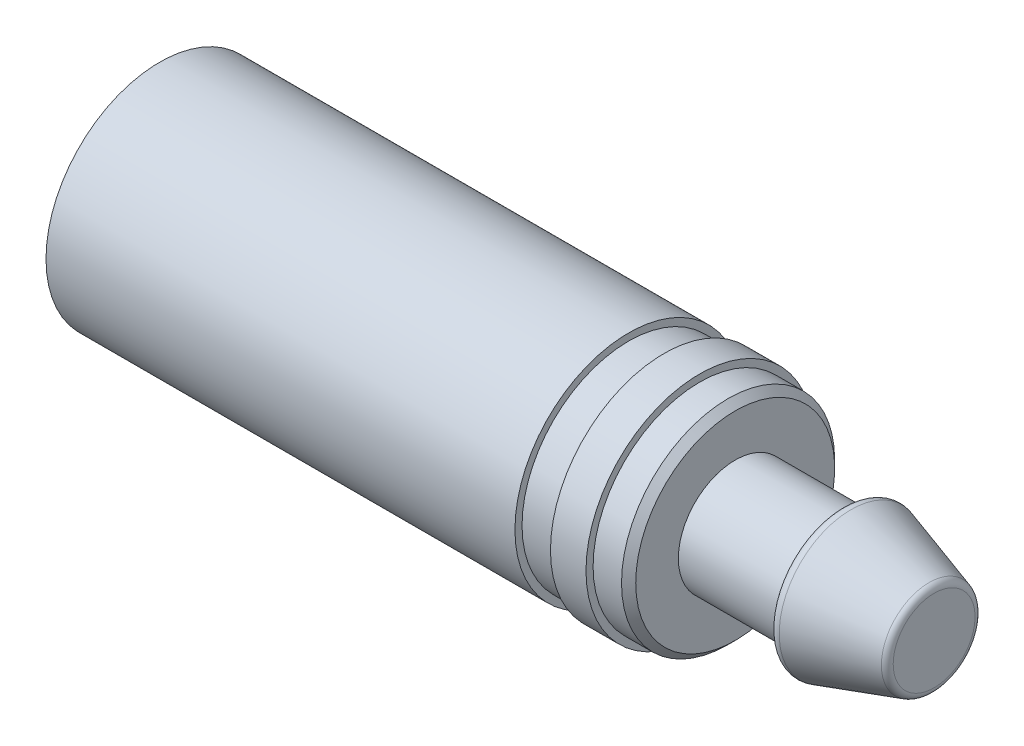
ISO-10303-21;
HEADER;
FILE_DESCRIPTION(('STEP AP214'),'2;1');
FILE_NAME('part.step','',(''),(''),'','','');
FILE_SCHEMA(('AUTOMOTIVE_DESIGN { 1 0 10303 214 1 1 1 1 }'));
ENDSEC;
DATA;
#1=APPLICATION_CONTEXT('core data for automotive mechanical design processes');
#2=APPLICATION_PROTOCOL_DEFINITION('international standard','automotive_design',2000,#1);
#3=PRODUCT_CONTEXT('',#1,'mechanical');
#4=PRODUCT('Part','Part','',(#3));
#5=PRODUCT_RELATED_PRODUCT_CATEGORY('part','',(#4));
#6=PRODUCT_DEFINITION_FORMATION('','',#4);
#7=PRODUCT_DEFINITION_CONTEXT('part definition',#1,'design');
#8=PRODUCT_DEFINITION('design','',#6,#7);
#9=PRODUCT_DEFINITION_SHAPE('','',#8);
#10=(LENGTH_UNIT() NAMED_UNIT(*) SI_UNIT(.MILLI.,.METRE.));
#11=(NAMED_UNIT(*) PLANE_ANGLE_UNIT() SI_UNIT($,.RADIAN.));
#12=(NAMED_UNIT(*) SI_UNIT($,.STERADIAN.) SOLID_ANGLE_UNIT());
#13=UNCERTAINTY_MEASURE_WITH_UNIT(LENGTH_MEASURE(1.E-05),#10,'distance_accuracy_value','');
#14=(GEOMETRIC_REPRESENTATION_CONTEXT(3) GLOBAL_UNCERTAINTY_ASSIGNED_CONTEXT((#13)) GLOBAL_UNIT_ASSIGNED_CONTEXT((#10,
#11,#12)) REPRESENTATION_CONTEXT('',''));
#15=CARTESIAN_POINT('',(0.,0.,0.));
#16=DIRECTION('',(0.,0.,1.));
#17=DIRECTION('',(1.,0.,0.));
#18=AXIS2_PLACEMENT_3D('',#15,#16,#17);
#19=CARTESIAN_POINT('',(109.,0.,0.));
#20=DIRECTION('',(-1.,0.,0.));
#21=DIRECTION('',(0.,0.,1.));
#22=AXIS2_PLACEMENT_3D('',#19,#20,#21);
#23=PLANE('',#22);
#24=CARTESIAN_POINT('',(109.,0.,0.));
#25=DIRECTION('',(-1.,0.,0.));
#26=DIRECTION('',(0.,0.,1.));
#27=AXIS2_PLACEMENT_3D('',#24,#25,#26);
#28=CIRCLE('',#27,5.76142534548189);
#29=CARTESIAN_POINT('',(109.,0.,5.76142534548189));
#30=VERTEX_POINT('',#29);
#31=EDGE_CURVE('E46',#30,#30,#28,.F.);
#32=ORIENTED_EDGE('',*,*,#31,.T.);
#33=EDGE_LOOP('',(#32));
#34=FACE_BOUND('',#33,.T.);
#35=ADVANCED_FACE('F31',(#34),#23,.F.);
#36=CARTESIAN_POINT('',(109.,0.,0.));
#37=DIRECTION('',(-1.,0.,0.));
#38=DIRECTION('',(0.,0.,1.));
#39=AXIS2_PLACEMENT_3D('',#36,#37,#38);
#40=CONICAL_SURFACE('',#39,6.5,0.29849893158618);
#41=CARTESIAN_POINT('',(108.294085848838,0.,0.));
#42=DIRECTION('',(1.,0.,0.));
#43=DIRECTION('',(0.,0.,-1.));
#44=AXIS2_PLACEMENT_3D('',#41,#42,#43);
#45=CIRCLE('',#44,6.71720435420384);
#46=CARTESIAN_POINT('',(108.294085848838,0.,-6.71720435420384));
#47=VERTEX_POINT('',#46);
#48=EDGE_CURVE('E51',#47,#47,#45,.F.);
#49=ORIENTED_EDGE('',*,*,#48,.T.);
#50=EDGE_LOOP('',(#49));
#51=FACE_BOUND('',#50,.T.);
#52=CARTESIAN_POINT('',(97.2940858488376,0.,0.));
#53=DIRECTION('',(1.,0.,0.));
#54=DIRECTION('',(0.,0.,-1.));
#55=AXIS2_PLACEMENT_3D('',#52,#53,#54);
#56=CIRCLE('',#55,10.1018197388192);
#57=CARTESIAN_POINT('',(97.2940858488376,0.,-10.1018197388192));
#58=VERTEX_POINT('',#57);
#59=EDGE_CURVE('E54',#58,#58,#56,.T.);
#60=ORIENTED_EDGE('',*,*,#59,.T.);
#61=EDGE_LOOP('',(#60));
#62=FACE_BOUND('',#61,.T.);
#63=ADVANCED_FACE('F133',(#51,#62),#40,.T.);
#64=CARTESIAN_POINT('',(96.,8.,0.));
#65=DIRECTION('',(1.,0.,0.));
#66=DIRECTION('',(0.,0.,-1.));
#67=AXIS2_PLACEMENT_3D('',#64,#65,#66);
#68=PLANE('',#67);
#69=CARTESIAN_POINT('',(96.,0.,0.));
#70=DIRECTION('',(1.,0.,0.));
#71=DIRECTION('',(0.,0.,-1.));
#72=AXIS2_PLACEMENT_3D('',#69,#70,#71);
#73=CIRCLE('',#72,9.14604073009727);
#74=CARTESIAN_POINT('',(96.,0.,-9.14604073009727));
#75=VERTEX_POINT('',#74);
#76=EDGE_CURVE('E42',#75,#75,#73,.F.);
#77=ORIENTED_EDGE('',*,*,#76,.T.);
#78=EDGE_LOOP('',(#77));
#79=FACE_BOUND('',#78,.T.);
#80=CARTESIAN_POINT('',(96.,0.,0.));
#81=DIRECTION('',(-1.,0.,0.));
#82=DIRECTION('',(0.,0.,1.));
#83=AXIS2_PLACEMENT_3D('',#80,#81,#82);
#84=CIRCLE('',#83,8.);
#85=CARTESIAN_POINT('',(96.,0.,8.));
#86=VERTEX_POINT('',#85);
#87=EDGE_CURVE('E57',#86,#86,#84,.T.);
#88=ORIENTED_EDGE('',*,*,#87,.F.);
#89=EDGE_LOOP('',(#88));
#90=FACE_BOUND('',#89,.T.);
#91=ADVANCED_FACE('F139',(#79,#90),#68,.F.);
#92=CARTESIAN_POINT('',(0.,0.,0.));
#93=DIRECTION('',(-1.,0.,0.));
#94=DIRECTION('',(0.,0.,1.));
#95=AXIS2_PLACEMENT_3D('',#92,#93,#94);
#96=CYLINDRICAL_SURFACE('',#95,8.);
#97=CARTESIAN_POINT('',(81.,0.,0.));
#98=DIRECTION('',(-1.,0.,0.));
#99=DIRECTION('',(0.,0.,1.));
#100=AXIS2_PLACEMENT_3D('',#97,#98,#99);
#101=CIRCLE('',#100,8.);
#102=CARTESIAN_POINT('',(81.,0.,8.));
#103=VERTEX_POINT('',#102);
#104=EDGE_CURVE('E60',#103,#103,#101,.T.);
#105=ORIENTED_EDGE('',*,*,#104,.F.);
#106=EDGE_LOOP('',(#105));
#107=FACE_BOUND('',#106,.T.);
#108=ORIENTED_EDGE('',*,*,#87,.T.);
#109=EDGE_LOOP('',(#108));
#110=FACE_BOUND('',#109,.T.);
#111=ADVANCED_FACE('F130',(#107,#110),#96,.T.);
#112=CARTESIAN_POINT('',(81.,15.,0.));
#113=DIRECTION('',(-1.,0.,0.));
#114=DIRECTION('',(0.,0.,1.));
#115=AXIS2_PLACEMENT_3D('',#112,#113,#114);
#116=PLANE('',#115);
#117=CARTESIAN_POINT('',(81.,0.,0.));
#118=DIRECTION('',(-1.,0.,0.));
#119=DIRECTION('',(0.,0.,1.));
#120=AXIS2_PLACEMENT_3D('',#117,#118,#119);
#121=CIRCLE('',#120,14.);
#122=CARTESIAN_POINT('',(81.,0.,14.));
#123=VERTEX_POINT('',#122);
#124=EDGE_CURVE('E10',#123,#123,#121,.F.);
#125=ORIENTED_EDGE('',*,*,#124,.T.);
#126=EDGE_LOOP('',(#125));
#127=FACE_BOUND('',#126,.T.);
#128=ORIENTED_EDGE('',*,*,#104,.T.);
#129=EDGE_LOOP('',(#128));
#130=FACE_BOUND('',#129,.T.);
#131=ADVANCED_FACE('F125',(#127,#130),#116,.F.);
#132=CARTESIAN_POINT('',(0.,0.,0.));
#133=DIRECTION('',(-1.,0.,0.));
#134=DIRECTION('',(0.,0.,1.));
#135=AXIS2_PLACEMENT_3D('',#132,#133,#134);
#136=CYLINDRICAL_SURFACE('',#135,15.);
#137=CARTESIAN_POINT('',(80.,0.,0.));
#138=DIRECTION('',(-1.,0.,0.));
#139=DIRECTION('',(0.,0.,1.));
#140=AXIS2_PLACEMENT_3D('',#137,#138,#139);
#141=CIRCLE('',#140,15.);
#142=CARTESIAN_POINT('',(80.,0.,15.));
#143=VERTEX_POINT('',#142);
#144=EDGE_CURVE('E38',#143,#143,#141,.T.);
#145=ORIENTED_EDGE('',*,*,#144,.T.);
#146=EDGE_LOOP('',(#145));
#147=FACE_BOUND('',#146,.T.);
#148=CARTESIAN_POINT('',(76.,0.,0.));
#149=DIRECTION('',(-1.,0.,0.));
#150=DIRECTION('',(0.,0.,1.));
#151=AXIS2_PLACEMENT_3D('',#148,#149,#150);
#152=CIRCLE('',#151,15.);
#153=CARTESIAN_POINT('',(76.,0.,15.));
#154=VERTEX_POINT('',#153);
#155=EDGE_CURVE('E63',#154,#154,#152,.T.);
#156=ORIENTED_EDGE('',*,*,#155,.F.);
#157=EDGE_LOOP('',(#156));
#158=FACE_BOUND('',#157,.T.);
#159=ADVANCED_FACE('F120',(#147,#158),#136,.T.);
#160=CARTESIAN_POINT('',(76.,16.,0.));
#161=DIRECTION('',(-1.,0.,0.));
#162=DIRECTION('',(0.,0.,1.));
#163=AXIS2_PLACEMENT_3D('',#160,#161,#162);
#164=PLANE('',#163);
#165=CARTESIAN_POINT('',(76.,0.,0.));
#166=DIRECTION('',(-1.,0.,0.));
#167=DIRECTION('',(0.,0.,1.));
#168=AXIS2_PLACEMENT_3D('',#165,#166,#167);
#169=CIRCLE('',#168,16.);
#170=CARTESIAN_POINT('',(76.,0.,16.));
#171=VERTEX_POINT('',#170);
#172=EDGE_CURVE('E66',#171,#171,#169,.T.);
#173=ORIENTED_EDGE('',*,*,#172,.F.);
#174=EDGE_LOOP('',(#173));
#175=FACE_BOUND('',#174,.T.);
#176=ORIENTED_EDGE('',*,*,#155,.T.);
#177=EDGE_LOOP('',(#176));
#178=FACE_BOUND('',#177,.T.);
#179=ADVANCED_FACE('F114',(#175,#178),#164,.F.);
#180=CARTESIAN_POINT('',(0.,0.,0.));
#181=DIRECTION('',(-1.,0.,0.));
#182=DIRECTION('',(0.,0.,1.));
#183=AXIS2_PLACEMENT_3D('',#180,#181,#182);
#184=CYLINDRICAL_SURFACE('',#183,16.);
#185=CARTESIAN_POINT('',(71.,0.,0.));
#186=DIRECTION('',(-1.,0.,0.));
#187=DIRECTION('',(0.,0.,1.));
#188=AXIS2_PLACEMENT_3D('',#185,#186,#187);
#189=CIRCLE('',#188,16.);
#190=CARTESIAN_POINT('',(71.,0.,16.));
#191=VERTEX_POINT('',#190);
#192=EDGE_CURVE('E69',#191,#191,#189,.T.);
#193=ORIENTED_EDGE('',*,*,#192,.F.);
#194=EDGE_LOOP('',(#193));
#195=FACE_BOUND('',#194,.T.);
#196=ORIENTED_EDGE('',*,*,#172,.T.);
#197=EDGE_LOOP('',(#196));
#198=FACE_BOUND('',#197,.T.);
#199=ADVANCED_FACE('F108',(#195,#198),#184,.T.);
#200=CARTESIAN_POINT('',(71.,15.,0.));
#201=DIRECTION('',(1.,0.,0.));
#202=DIRECTION('',(0.,0.,-1.));
#203=AXIS2_PLACEMENT_3D('',#200,#201,#202);
#204=PLANE('',#203);
#205=CARTESIAN_POINT('',(71.,0.,0.));
#206=DIRECTION('',(-1.,0.,0.));
#207=DIRECTION('',(0.,0.,1.));
#208=AXIS2_PLACEMENT_3D('',#205,#206,#207);
#209=CIRCLE('',#208,15.);
#210=CARTESIAN_POINT('',(71.,0.,15.));
#211=VERTEX_POINT('',#210);
#212=EDGE_CURVE('E72',#211,#211,#209,.T.);
#213=ORIENTED_EDGE('',*,*,#212,.F.);
#214=EDGE_LOOP('',(#213));
#215=FACE_BOUND('',#214,.T.);
#216=ORIENTED_EDGE('',*,*,#192,.T.);
#217=EDGE_LOOP('',(#216));
#218=FACE_BOUND('',#217,.T.);
#219=ADVANCED_FACE('F102',(#215,#218),#204,.F.);
#220=CARTESIAN_POINT('',(0.,0.,0.));
#221=DIRECTION('',(-1.,0.,0.));
#222=DIRECTION('',(0.,0.,1.));
#223=AXIS2_PLACEMENT_3D('',#220,#221,#222);
#224=CYLINDRICAL_SURFACE('',#223,15.);
#225=CARTESIAN_POINT('',(66.,0.,0.));
#226=DIRECTION('',(-1.,0.,0.));
#227=DIRECTION('',(0.,0.,1.));
#228=AXIS2_PLACEMENT_3D('',#225,#226,#227);
#229=CIRCLE('',#228,15.);
#230=CARTESIAN_POINT('',(66.,0.,15.));
#231=VERTEX_POINT('',#230);
#232=EDGE_CURVE('E75',#231,#231,#229,.T.);
#233=ORIENTED_EDGE('',*,*,#232,.F.);
#234=EDGE_LOOP('',(#233));
#235=FACE_BOUND('',#234,.T.);
#236=ORIENTED_EDGE('',*,*,#212,.T.);
#237=EDGE_LOOP('',(#236));
#238=FACE_BOUND('',#237,.T.);
#239=ADVANCED_FACE('F96',(#235,#238),#224,.T.);
#240=CARTESIAN_POINT('',(66.,16.,0.));
#241=DIRECTION('',(-1.,0.,0.));
#242=DIRECTION('',(0.,0.,1.));
#243=AXIS2_PLACEMENT_3D('',#240,#241,#242);
#244=PLANE('',#243);
#245=CARTESIAN_POINT('',(66.,0.,0.));
#246=DIRECTION('',(-1.,0.,0.));
#247=DIRECTION('',(0.,0.,1.));
#248=AXIS2_PLACEMENT_3D('',#245,#246,#247);
#249=CIRCLE('',#248,16.);
#250=CARTESIAN_POINT('',(66.,0.,16.));
#251=VERTEX_POINT('',#250);
#252=EDGE_CURVE('E78',#251,#251,#249,.T.);
#253=ORIENTED_EDGE('',*,*,#252,.F.);
#254=EDGE_LOOP('',(#253));
#255=FACE_BOUND('',#254,.T.);
#256=ORIENTED_EDGE('',*,*,#232,.T.);
#257=EDGE_LOOP('',(#256));
#258=FACE_BOUND('',#257,.T.);
#259=ADVANCED_FACE('F90',(#255,#258),#244,.F.);
#260=CARTESIAN_POINT('',(0.,0.,0.));
#261=DIRECTION('',(-1.,0.,0.));
#262=DIRECTION('',(0.,0.,1.));
#263=AXIS2_PLACEMENT_3D('',#260,#261,#262);
#264=CYLINDRICAL_SURFACE('',#263,16.);
#265=CARTESIAN_POINT('',(0.,0.,0.));
#266=DIRECTION('',(-1.,0.,0.));
#267=DIRECTION('',(0.,0.,1.));
#268=AXIS2_PLACEMENT_3D('',#265,#266,#267);
#269=CIRCLE('',#268,16.);
#270=CARTESIAN_POINT('',(0.,0.,16.));
#271=VERTEX_POINT('',#270);
#272=EDGE_CURVE('E81',#271,#271,#269,.T.);
#273=ORIENTED_EDGE('',*,*,#272,.F.);
#274=EDGE_LOOP('',(#273));
#275=FACE_BOUND('',#274,.T.);
#276=ORIENTED_EDGE('',*,*,#252,.T.);
#277=EDGE_LOOP('',(#276));
#278=FACE_BOUND('',#277,.T.);
#279=ADVANCED_FACE('F87',(#275,#278),#264,.T.);
#280=CARTESIAN_POINT('',(0.,0.,0.));
#281=DIRECTION('',(1.,0.,0.));
#282=DIRECTION('',(0.,0.,-1.));
#283=AXIS2_PLACEMENT_3D('',#280,#281,#282);
#284=PLANE('',#283);
#285=ORIENTED_EDGE('',*,*,#272,.T.);
#286=EDGE_LOOP('',(#285));
#287=FACE_BOUND('',#286,.T.);
#288=ADVANCED_FACE('F85',(#287),#284,.F.);
#289=CARTESIAN_POINT('',(108.,0.,0.));
#290=DIRECTION('',(-1.,0.,0.));
#291=DIRECTION('',(0.,0.,1.));
#292=AXIS2_PLACEMENT_3D('',#289,#290,#291);
#293=TOROIDAL_SURFACE('',#292,5.76142534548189,1.);
#294=ORIENTED_EDGE('',*,*,#31,.F.);
#295=EDGE_LOOP('',(#294));
#296=FACE_BOUND('',#295,.T.);
#297=ORIENTED_EDGE('',*,*,#48,.F.);
#298=EDGE_LOOP('',(#297));
#299=FACE_BOUND('',#298,.T.);
#300=ADVANCED_FACE('F144',(#296,#299),#293,.T.);
#301=CARTESIAN_POINT('',(97.,0.,0.));
#302=DIRECTION('',(1.,0.,0.));
#303=DIRECTION('',(0.,0.,-1.));
#304=AXIS2_PLACEMENT_3D('',#301,#302,#303);
#305=TOROIDAL_SURFACE('',#304,9.14604073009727,1.);
#306=ORIENTED_EDGE('',*,*,#59,.F.);
#307=EDGE_LOOP('',(#306));
#308=FACE_BOUND('',#307,.T.);
#309=ORIENTED_EDGE('',*,*,#76,.F.);
#310=EDGE_LOOP('',(#309));
#311=FACE_BOUND('',#310,.T.);
#312=ADVANCED_FACE('F146',(#308,#311),#305,.T.);
#313=CARTESIAN_POINT('',(80.,0.,0.));
#314=DIRECTION('',(-1.,0.,0.));
#315=DIRECTION('',(0.,0.,1.));
#316=AXIS2_PLACEMENT_3D('',#313,#314,#315);
#317=CONICAL_SURFACE('',#316,15.,0.785398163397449);
#318=ORIENTED_EDGE('',*,*,#124,.F.);
#319=EDGE_LOOP('',(#318));
#320=FACE_BOUND('',#319,.T.);
#321=ORIENTED_EDGE('',*,*,#144,.F.);
#322=EDGE_LOOP('',(#321));
#323=FACE_BOUND('',#322,.T.);
#324=ADVANCED_FACE('F33',(#320,#323),#317,.T.);
#325=CLOSED_SHELL('',(#35,#63,#91,#111,#131,#159,#179,#199,#219,#239,#259,#279,#288,#300,#312,#324));
#326=MANIFOLD_SOLID_BREP('B2',#325);
#327=ADVANCED_BREP_SHAPE_REPRESENTATION('',(#18,#326),#14);
#328=SHAPE_DEFINITION_REPRESENTATION(#9,#327);
ENDSEC;
END-ISO-10303-21;
